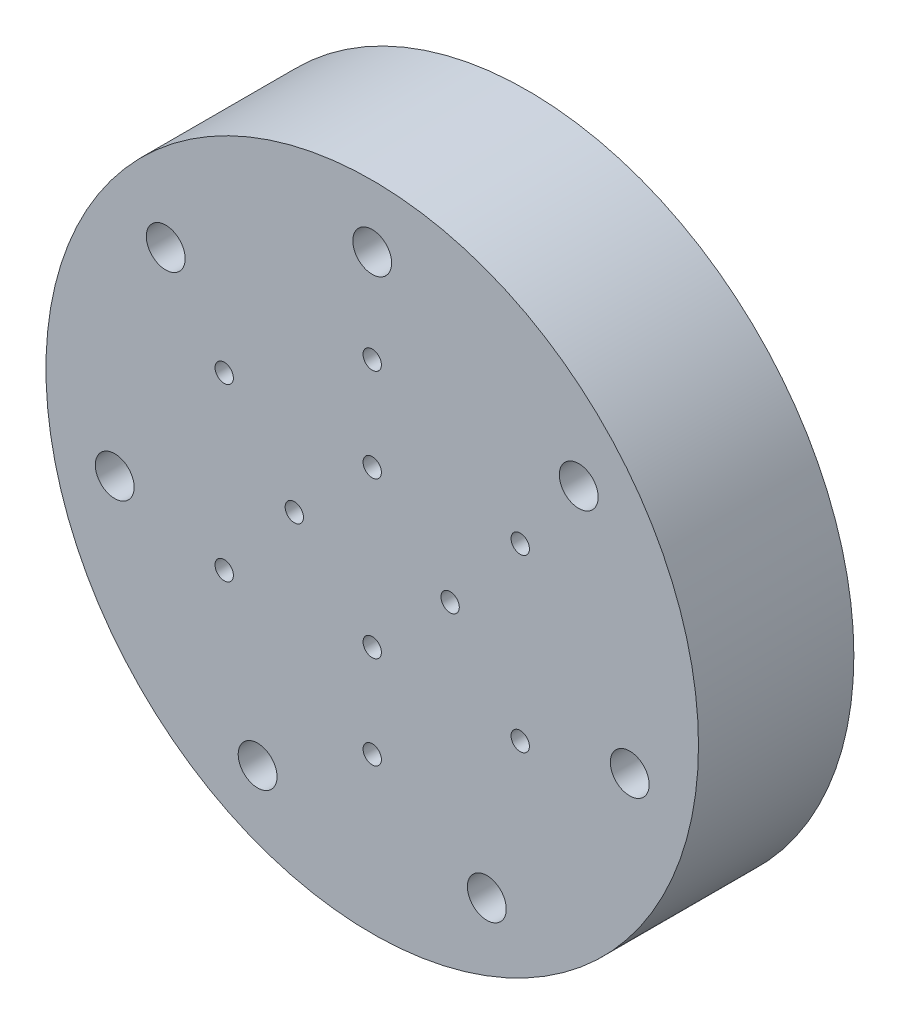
from build123d import *

# Parameters (mm, degrees)
SKETCH1_R           = 26.67
BOSS_EXTRUDE1_DEPTH = 12.7
SKETCH3_R           = 1.5875
CUT_EXTRUDE3_DEPTH  = 40.797836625
CIRPATTERN3_COUNT   = 7
SKETCH4_R           = 0.75
CUT_EXTRUDE4_DEPTH  = 40.797836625
SKETCH4_3_R         = 0.75
CUT_EXTRUDE5_DEPTH  = 40.797836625
CIRPATTERN4_COUNT   = 4
CIRPATTERN5_COUNT   = 6


with BuildPart() as part:
    # Sketch1 → Boss-Extrude1 (new body)
    with BuildSketch(Plane.XY):
        Circle(SKETCH1_R)
    extrude(amount=BOSS_EXTRUDE1_DEPTH)

    # Sketch3 → Cut-Extrude3 (cut, through all)
    with BuildSketch(Plane.XY.offset(12.7)):
        with Locations((0, 21.59)):
            Circle(SKETCH3_R)
    cut_extrude3 = extrude(amount=-CUT_EXTRUDE3_DEPTH, mode=Mode.SUBTRACT)

    # CirPattern3: Cut-Extrude3 ×7 about axis
    cirpattern3_axis = Axis((0, 0, 0), (0, 0, 1))
    for i in range(1, CIRPATTERN3_COUNT):
        add(cut_extrude3.rotate(cirpattern3_axis, i * 360 / CIRPATTERN3_COUNT), mode=Mode.SUBTRACT)

    # Sketch4 → Cut-Extrude4 (cut, through all)
    with BuildSketch(Plane.XY.offset(12.7)):
        with Locations((0, 13.97)):
            Circle(SKETCH4_R)
    cut_extrude4 = extrude(amount=-CUT_EXTRUDE4_DEPTH, mode=Mode.SUBTRACT)

    # Sketch4_3 → Cut-Extrude5 (cut, through all)
    with BuildSketch(Plane.XY.offset(12.7)):
        with Locations((0, 6.35)):
            Circle(SKETCH4_3_R)
    cut_extrude5 = extrude(amount=-CUT_EXTRUDE5_DEPTH, mode=Mode.SUBTRACT)

    # CirPattern4: Cut-Extrude5 ×4 about axis
    cirpattern4_axis = Axis((0, -0.016504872, 0), (0, 0, 1))
    for i in range(1, CIRPATTERN4_COUNT):
        add(cut_extrude5.rotate(cirpattern4_axis, i * 360 / CIRPATTERN4_COUNT), mode=Mode.SUBTRACT)

    # CirPattern5: Cut-Extrude4 ×6 about axis
    cirpattern5_axis = Axis((0, 0, 0), (0, 0, 1))
    for i in range(1, CIRPATTERN5_COUNT):
        add(cut_extrude4.rotate(cirpattern5_axis, i * 360 / CIRPATTERN5_COUNT), mode=Mode.SUBTRACT)


solid = part.part
